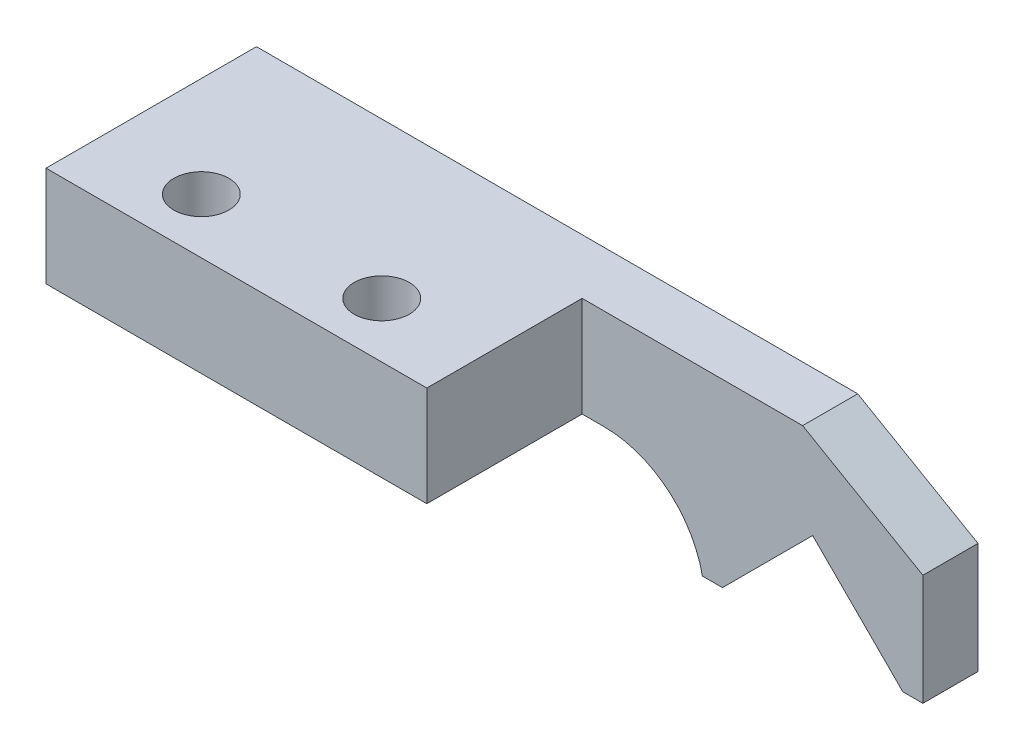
from build123d import *

# Parameters (mm, degrees)
BASE_EXTRUSION_DEPTH    = 21
ESQUISSE2_W             = 56.002380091
ESQUISSE2_H             = 20.539256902
ENL_V_MAT_EXTRU_1_DEPTH = 78.129760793
ESQUISSE3_R             = 5
ENL_V_MAT_EXTRU_2_DEPTH = 6
ESQUISSE4_R             = 2.75
ENL_V_MAT_EXTRU_3_DEPTH = 6


with BuildPart() as part:
    # Esquisse1 → Base-Extrusion (new body)
    with BuildSketch(Plane.XY):
        with BuildLine():
            Line((0, 0), (0, 10))
            Line((0, 10), (60, 10))
            Line((60, 10), (72, 3.07179677))
            Line((72, 3.07179677), (72, -8))
            Line((72, -8), (70, -8))
            Line((70, -8), (61, 1))
            Line((61, 1), (52, -8))
            Line((52, -8), (50, -8))
            ThreePointArc((50, -8), (46.526596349, -2.254033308), (40.202041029, 0))
            Line((40.202041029, 0), (0, 0))
        make_face()
    extrude(amount=BASE_EXTRUSION_DEPTH)

    # Esquisse2 → Enl_v. mat.-Extru.1 (cut, through all)
    with BuildSketch(Plane(origin=(0, 10, 0), x_dir=(-1, 0, 0), z_dir=(0, 1, 0))):
        with Locations((-66.001190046, 15.769628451)):
            Rectangle(ESQUISSE2_W, ESQUISSE2_H)
    extrude(amount=-ENL_V_MAT_EXTRU_1_DEPTH, mode=Mode.SUBTRACT)

    # Esquisse3 → Enl_v. mat.-Extru.2 (cut)
    with BuildSketch(Plane.XZ):
        with Locations(Location((28, 15.5, 0), (0, 0, 270))):
            Circle(ESQUISSE3_R)
        with Locations(Location((10, 15.5, 0), (0, 0, 270))):
            Circle(ESQUISSE3_R)
    extrude(amount=-ENL_V_MAT_EXTRU_2_DEPTH, mode=Mode.SUBTRACT)

    # Esquisse4 → Enl_v. mat.-Extru.3 (cut)
    with BuildSketch(Plane.XZ.offset(-6)):
        with Locations(Location((28, 15.5, 0), (0, 0, 270))):
            Circle(ESQUISSE4_R)
        with Locations(Location((10, 15.5, 0), (0, 0, 270))):
            Circle(ESQUISSE4_R)
    extrude(amount=-ENL_V_MAT_EXTRU_3_DEPTH, mode=Mode.SUBTRACT)


solid = part.part
